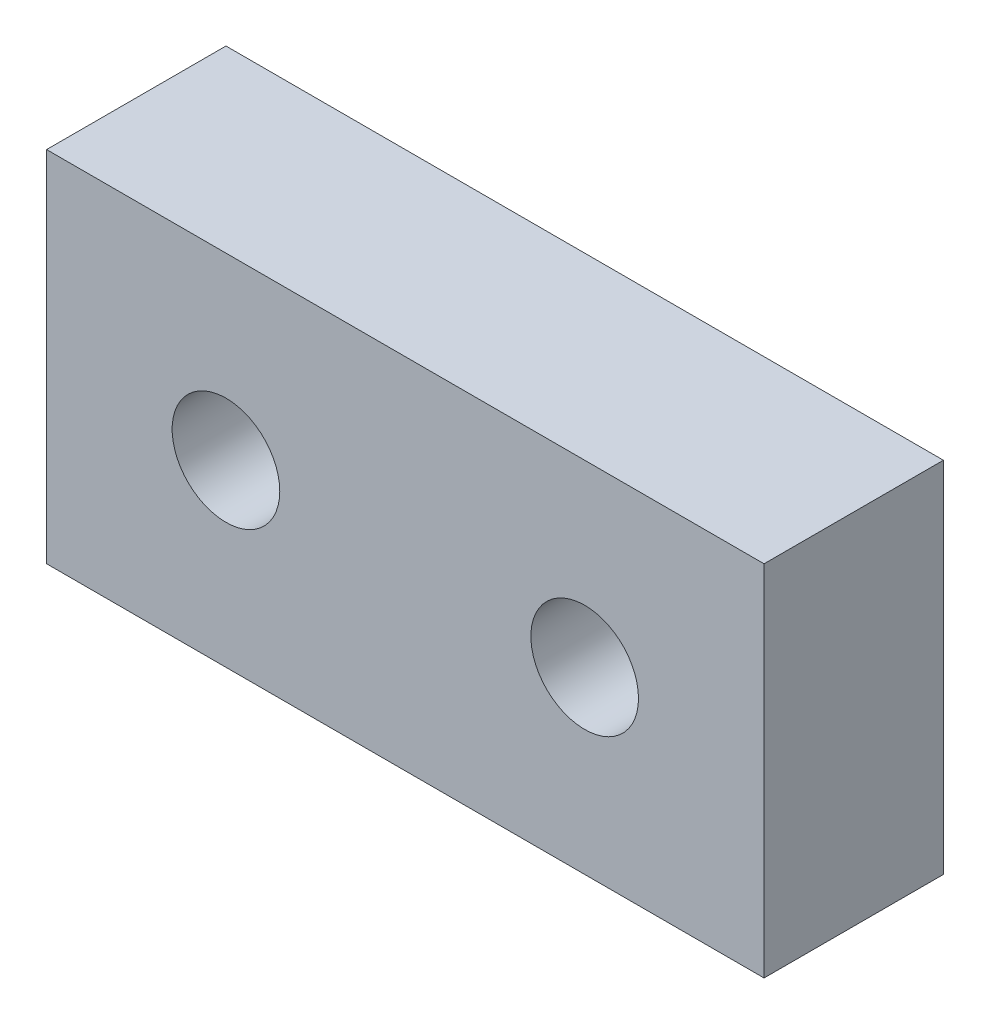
ISO-10303-21;
HEADER;
FILE_DESCRIPTION(('STEP AP214'),'2;1');
FILE_NAME('part.step','',(''),(''),'','','');
FILE_SCHEMA(('AUTOMOTIVE_DESIGN { 1 0 10303 214 1 1 1 1 }'));
ENDSEC;
DATA;
#1=APPLICATION_CONTEXT('core data for automotive mechanical design processes');
#2=APPLICATION_PROTOCOL_DEFINITION('international standard','automotive_design',2000,#1);
#3=PRODUCT_CONTEXT('',#1,'mechanical');
#4=PRODUCT('Part','Part','',(#3));
#5=PRODUCT_RELATED_PRODUCT_CATEGORY('part','',(#4));
#6=PRODUCT_DEFINITION_FORMATION('','',#4);
#7=PRODUCT_DEFINITION_CONTEXT('part definition',#1,'design');
#8=PRODUCT_DEFINITION('design','',#6,#7);
#9=PRODUCT_DEFINITION_SHAPE('','',#8);
#10=(LENGTH_UNIT() NAMED_UNIT(*) SI_UNIT(.MILLI.,.METRE.));
#11=(NAMED_UNIT(*) PLANE_ANGLE_UNIT() SI_UNIT($,.RADIAN.));
#12=(NAMED_UNIT(*) SI_UNIT($,.STERADIAN.) SOLID_ANGLE_UNIT());
#13=UNCERTAINTY_MEASURE_WITH_UNIT(LENGTH_MEASURE(1.E-05),#10,'distance_accuracy_value','');
#14=(GEOMETRIC_REPRESENTATION_CONTEXT(3) GLOBAL_UNCERTAINTY_ASSIGNED_CONTEXT((#13)) GLOBAL_UNIT_ASSIGNED_CONTEXT((#10,
#11,#12)) REPRESENTATION_CONTEXT('',''));
#15=CARTESIAN_POINT('',(0.,0.,0.));
#16=DIRECTION('',(0.,0.,1.));
#17=DIRECTION('',(1.,0.,0.));
#18=AXIS2_PLACEMENT_3D('',#15,#16,#17);
#19=CARTESIAN_POINT('',(-100.,50.,50.));
#20=DIRECTION('',(1.,0.,0.));
#21=DIRECTION('',(0.,1.,0.));
#22=AXIS2_PLACEMENT_3D('',#19,#20,#21);
#23=PLANE('',#22);
#24=DIRECTION('',(0.,-1.,0.));
#25=VECTOR('',#24,1.);
#26=CARTESIAN_POINT('',(-100.,50.,0.));
#27=LINE('',#26,#25);
#28=CARTESIAN_POINT('',(-100.,50.,0.));
#29=VERTEX_POINT('',#28);
#30=CARTESIAN_POINT('',(-100.,-50.,0.));
#31=VERTEX_POINT('',#30);
#32=EDGE_CURVE('E75',#29,#31,#27,.T.);
#33=ORIENTED_EDGE('',*,*,#32,.T.);
#34=DIRECTION('',(0.,0.,-1.));
#35=VECTOR('',#34,1.);
#36=CARTESIAN_POINT('',(-100.,-50.,50.));
#37=LINE('',#36,#35);
#38=CARTESIAN_POINT('',(-100.,-50.,50.));
#39=VERTEX_POINT('',#38);
#40=EDGE_CURVE('E11',#39,#31,#37,.T.);
#41=ORIENTED_EDGE('',*,*,#40,.F.);
#42=DIRECTION('',(0.,-1.,0.));
#43=VECTOR('',#42,1.);
#44=CARTESIAN_POINT('',(-100.,50.,50.));
#45=LINE('',#44,#43);
#46=CARTESIAN_POINT('',(-100.,50.,50.));
#47=VERTEX_POINT('',#46);
#48=EDGE_CURVE('E98',#47,#39,#45,.T.);
#49=ORIENTED_EDGE('',*,*,#48,.F.);
#50=DIRECTION('',(0.,0.,-1.));
#51=VECTOR('',#50,1.);
#52=CARTESIAN_POINT('',(-100.,50.,50.));
#53=LINE('',#52,#51);
#54=EDGE_CURVE('E87',#47,#29,#53,.T.);
#55=ORIENTED_EDGE('',*,*,#54,.T.);
#56=EDGE_LOOP('',(#33,#41,#49,#55));
#57=FACE_BOUND('',#56,.T.);
#58=ADVANCED_FACE('F31',(#57),#23,.F.);
#59=CARTESIAN_POINT('',(-100.,-50.,50.));
#60=DIRECTION('',(0.,1.,0.));
#61=DIRECTION('',(-1.,0.,0.));
#62=AXIS2_PLACEMENT_3D('',#59,#60,#61);
#63=PLANE('',#62);
#64=DIRECTION('',(1.,0.,0.));
#65=VECTOR('',#64,1.);
#66=CARTESIAN_POINT('',(-100.,-50.,0.));
#67=LINE('',#66,#65);
#68=CARTESIAN_POINT('',(100.,-50.,0.));
#69=VERTEX_POINT('',#68);
#70=EDGE_CURVE('E71',#31,#69,#67,.T.);
#71=ORIENTED_EDGE('',*,*,#70,.T.);
#72=DIRECTION('',(0.,0.,-1.));
#73=VECTOR('',#72,1.);
#74=CARTESIAN_POINT('',(100.,-50.,50.));
#75=LINE('',#74,#73);
#76=CARTESIAN_POINT('',(100.,-50.,50.));
#77=VERTEX_POINT('',#76);
#78=EDGE_CURVE('E38',#77,#69,#75,.T.);
#79=ORIENTED_EDGE('',*,*,#78,.F.);
#80=DIRECTION('',(1.,0.,0.));
#81=VECTOR('',#80,1.);
#82=CARTESIAN_POINT('',(-100.,-50.,50.));
#83=LINE('',#82,#81);
#84=EDGE_CURVE('E83',#39,#77,#83,.T.);
#85=ORIENTED_EDGE('',*,*,#84,.F.);
#86=ORIENTED_EDGE('',*,*,#40,.T.);
#87=EDGE_LOOP('',(#71,#79,#85,#86));
#88=FACE_BOUND('',#87,.T.);
#89=ADVANCED_FACE('F82',(#88),#63,.F.);
#90=CARTESIAN_POINT('',(100.,50.,50.));
#91=DIRECTION('',(-1.,0.,0.));
#92=DIRECTION('',(0.,0.,1.));
#93=AXIS2_PLACEMENT_3D('',#90,#91,#92);
#94=PLANE('',#93);
#95=DIRECTION('',(0.,1.,0.));
#96=VECTOR('',#95,1.);
#97=CARTESIAN_POINT('',(100.,50.,0.));
#98=LINE('',#97,#96);
#99=CARTESIAN_POINT('',(100.,50.,0.));
#100=VERTEX_POINT('',#99);
#101=EDGE_CURVE('E76',#69,#100,#98,.T.);
#102=ORIENTED_EDGE('',*,*,#101,.T.);
#103=DIRECTION('',(0.,0.,-1.));
#104=VECTOR('',#103,1.);
#105=CARTESIAN_POINT('',(100.,50.,50.));
#106=LINE('',#105,#104);
#107=CARTESIAN_POINT('',(100.,50.,50.));
#108=VERTEX_POINT('',#107);
#109=EDGE_CURVE('E104',#108,#100,#106,.T.);
#110=ORIENTED_EDGE('',*,*,#109,.F.);
#111=DIRECTION('',(0.,1.,0.));
#112=VECTOR('',#111,1.);
#113=CARTESIAN_POINT('',(100.,50.,50.));
#114=LINE('',#113,#112);
#115=EDGE_CURVE('E50',#77,#108,#114,.T.);
#116=ORIENTED_EDGE('',*,*,#115,.F.);
#117=ORIENTED_EDGE('',*,*,#78,.T.);
#118=EDGE_LOOP('',(#102,#110,#116,#117));
#119=FACE_BOUND('',#118,.T.);
#120=ADVANCED_FACE('F107',(#119),#94,.F.);
#121=CARTESIAN_POINT('',(-100.,50.,50.));
#122=DIRECTION('',(0.,-1.,0.));
#123=DIRECTION('',(1.,0.,0.));
#124=AXIS2_PLACEMENT_3D('',#121,#122,#123);
#125=PLANE('',#124);
#126=DIRECTION('',(-1.,0.,0.));
#127=VECTOR('',#126,1.);
#128=CARTESIAN_POINT('',(-100.,50.,0.));
#129=LINE('',#128,#127);
#130=EDGE_CURVE('E96',#100,#29,#129,.T.);
#131=ORIENTED_EDGE('',*,*,#130,.T.);
#132=ORIENTED_EDGE('',*,*,#54,.F.);
#133=DIRECTION('',(-1.,0.,0.));
#134=VECTOR('',#133,1.);
#135=CARTESIAN_POINT('',(-100.,50.,50.));
#136=LINE('',#135,#134);
#137=EDGE_CURVE('E45',#108,#47,#136,.T.);
#138=ORIENTED_EDGE('',*,*,#137,.F.);
#139=ORIENTED_EDGE('',*,*,#109,.T.);
#140=EDGE_LOOP('',(#131,#132,#138,#139));
#141=FACE_BOUND('',#140,.T.);
#142=ADVANCED_FACE('F109',(#141),#125,.F.);
#143=CARTESIAN_POINT('',(-100.,-50.,50.));
#144=DIRECTION('',(0.,0.,1.));
#145=DIRECTION('',(1.,0.,0.));
#146=AXIS2_PLACEMENT_3D('',#143,#144,#145);
#147=PLANE('',#146);
#148=CARTESIAN_POINT('',(50.,0.,50.));
#149=DIRECTION('',(0.,0.,1.));
#150=DIRECTION('',(1.,0.,0.));
#151=AXIS2_PLACEMENT_3D('',#148,#149,#150);
#152=CIRCLE('',#151,15.);
#153=CARTESIAN_POINT('',(65.,0.,50.));
#154=VERTEX_POINT('',#153);
#155=EDGE_CURVE('E176',#154,#154,#152,.T.);
#156=ORIENTED_EDGE('',*,*,#155,.F.);
#157=EDGE_LOOP('',(#156));
#158=FACE_BOUND('',#157,.T.);
#159=CARTESIAN_POINT('',(-50.,0.,50.));
#160=DIRECTION('',(0.,0.,1.));
#161=DIRECTION('',(1.,0.,0.));
#162=AXIS2_PLACEMENT_3D('',#159,#160,#161);
#163=CIRCLE('',#162,15.);
#164=CARTESIAN_POINT('',(-35.,0.,50.));
#165=VERTEX_POINT('',#164);
#166=EDGE_CURVE('E91',#165,#165,#163,.T.);
#167=ORIENTED_EDGE('',*,*,#166,.F.);
#168=EDGE_LOOP('',(#167));
#169=FACE_BOUND('',#168,.T.);
#170=ORIENTED_EDGE('',*,*,#48,.T.);
#171=ORIENTED_EDGE('',*,*,#84,.T.);
#172=ORIENTED_EDGE('',*,*,#115,.T.);
#173=ORIENTED_EDGE('',*,*,#137,.T.);
#174=EDGE_LOOP('',(#170,#171,#172,#173));
#175=FACE_BOUND('',#174,.T.);
#176=ADVANCED_FACE('F110',(#158,#169,#175),#147,.T.);
#177=CARTESIAN_POINT('',(-100.,-50.,0.));
#178=DIRECTION('',(0.,0.,1.));
#179=DIRECTION('',(1.,0.,0.));
#180=AXIS2_PLACEMENT_3D('',#177,#178,#179);
#181=PLANE('',#180);
#182=CARTESIAN_POINT('',(50.,0.,0.));
#183=DIRECTION('',(0.,0.,1.));
#184=DIRECTION('',(1.,0.,0.));
#185=AXIS2_PLACEMENT_3D('',#182,#183,#184);
#186=CIRCLE('',#185,15.);
#187=CARTESIAN_POINT('',(65.,0.,0.));
#188=VERTEX_POINT('',#187);
#189=EDGE_CURVE('E174',#188,#188,#186,.T.);
#190=ORIENTED_EDGE('',*,*,#189,.T.);
#191=EDGE_LOOP('',(#190));
#192=FACE_BOUND('',#191,.T.);
#193=CARTESIAN_POINT('',(-50.,0.,0.));
#194=DIRECTION('',(0.,0.,1.));
#195=DIRECTION('',(1.,0.,0.));
#196=AXIS2_PLACEMENT_3D('',#193,#194,#195);
#197=CIRCLE('',#196,15.);
#198=CARTESIAN_POINT('',(-35.,0.,0.));
#199=VERTEX_POINT('',#198);
#200=EDGE_CURVE('E88',#199,#199,#197,.T.);
#201=ORIENTED_EDGE('',*,*,#200,.T.);
#202=EDGE_LOOP('',(#201));
#203=FACE_BOUND('',#202,.T.);
#204=ORIENTED_EDGE('',*,*,#32,.F.);
#205=ORIENTED_EDGE('',*,*,#130,.F.);
#206=ORIENTED_EDGE('',*,*,#101,.F.);
#207=ORIENTED_EDGE('',*,*,#70,.F.);
#208=EDGE_LOOP('',(#204,#205,#206,#207));
#209=FACE_BOUND('',#208,.T.);
#210=ADVANCED_FACE('F72',(#192,#203,#209),#181,.F.);
#211=CARTESIAN_POINT('',(-50.,0.,0.));
#212=DIRECTION('',(0.,0.,1.));
#213=DIRECTION('',(1.,0.,0.));
#214=AXIS2_PLACEMENT_3D('',#211,#212,#213);
#215=CYLINDRICAL_SURFACE('',#214,15.);
#216=ORIENTED_EDGE('',*,*,#200,.F.);
#217=EDGE_LOOP('',(#216));
#218=FACE_BOUND('',#217,.T.);
#219=ORIENTED_EDGE('',*,*,#166,.T.);
#220=EDGE_LOOP('',(#219));
#221=FACE_BOUND('',#220,.T.);
#222=ADVANCED_FACE('F118',(#218,#221),#215,.F.);
#223=CARTESIAN_POINT('',(50.,0.,0.));
#224=DIRECTION('',(0.,0.,1.));
#225=DIRECTION('',(1.,0.,0.));
#226=AXIS2_PLACEMENT_3D('',#223,#224,#225);
#227=CYLINDRICAL_SURFACE('',#226,15.);
#228=ORIENTED_EDGE('',*,*,#189,.F.);
#229=EDGE_LOOP('',(#228));
#230=FACE_BOUND('',#229,.T.);
#231=ORIENTED_EDGE('',*,*,#155,.T.);
#232=EDGE_LOOP('',(#231));
#233=FACE_BOUND('',#232,.T.);
#234=ADVANCED_FACE('F157',(#230,#233),#227,.F.);
#235=CLOSED_SHELL('',(#58,#89,#120,#142,#176,#210,#222,#234));
#236=MANIFOLD_SOLID_BREP('B2',#235);
#237=ADVANCED_BREP_SHAPE_REPRESENTATION('',(#18,#236),#14);
#238=SHAPE_DEFINITION_REPRESENTATION(#9,#237);
ENDSEC;
END-ISO-10303-21;
